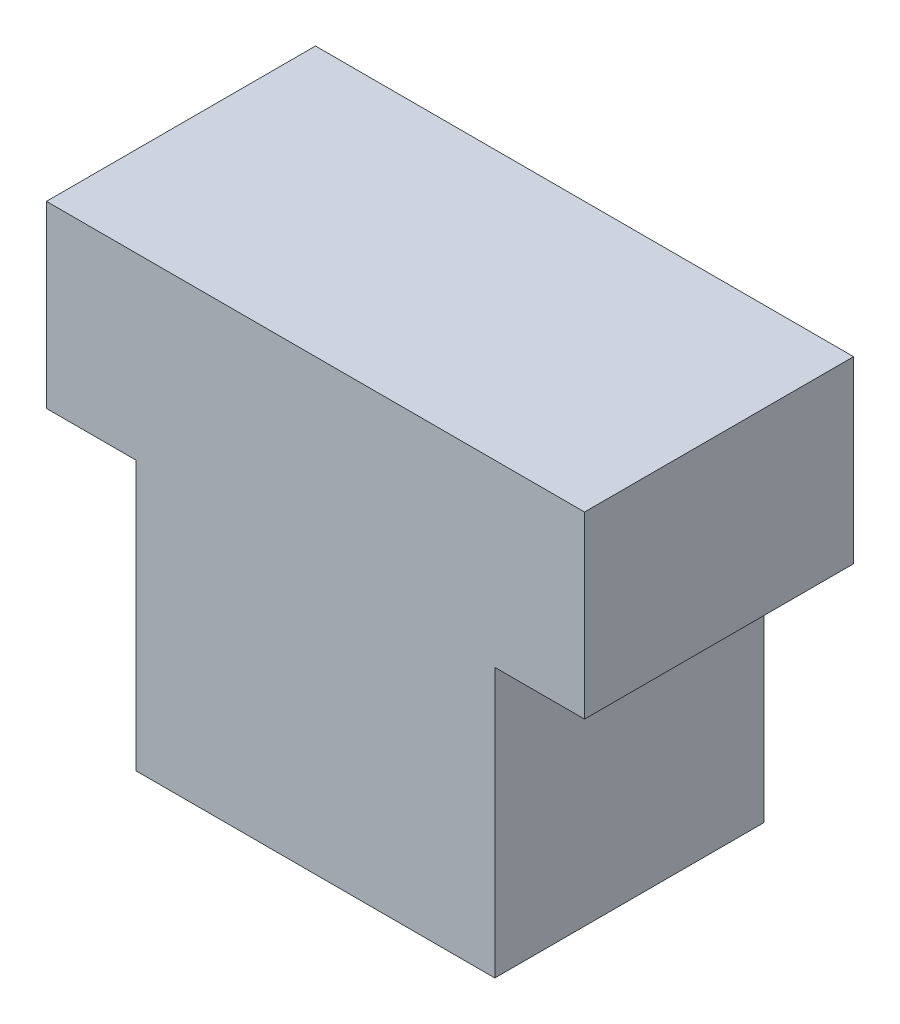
ISO-10303-21;
HEADER;
FILE_DESCRIPTION(('STEP AP214'),'2;1');
FILE_NAME('part.step','',(''),(''),'','','');
FILE_SCHEMA(('AUTOMOTIVE_DESIGN { 1 0 10303 214 1 1 1 1 }'));
ENDSEC;
DATA;
#1=APPLICATION_CONTEXT('core data for automotive mechanical design processes');
#2=APPLICATION_PROTOCOL_DEFINITION('international standard','automotive_design',2000,#1);
#3=PRODUCT_CONTEXT('',#1,'mechanical');
#4=PRODUCT('Part','Part','',(#3));
#5=PRODUCT_RELATED_PRODUCT_CATEGORY('part','',(#4));
#6=PRODUCT_DEFINITION_FORMATION('','',#4);
#7=PRODUCT_DEFINITION_CONTEXT('part definition',#1,'design');
#8=PRODUCT_DEFINITION('design','',#6,#7);
#9=PRODUCT_DEFINITION_SHAPE('','',#8);
#10=(LENGTH_UNIT() NAMED_UNIT(*) SI_UNIT(.MILLI.,.METRE.));
#11=(NAMED_UNIT(*) PLANE_ANGLE_UNIT() SI_UNIT($,.RADIAN.));
#12=(NAMED_UNIT(*) SI_UNIT($,.STERADIAN.) SOLID_ANGLE_UNIT());
#13=UNCERTAINTY_MEASURE_WITH_UNIT(LENGTH_MEASURE(1.E-05),#10,'distance_accuracy_value','');
#14=(GEOMETRIC_REPRESENTATION_CONTEXT(3) GLOBAL_UNCERTAINTY_ASSIGNED_CONTEXT((#13)) GLOBAL_UNIT_ASSIGNED_CONTEXT((#10,
#11,#12)) REPRESENTATION_CONTEXT('',''));
#15=CARTESIAN_POINT('',(0.,0.,0.));
#16=DIRECTION('',(0.,0.,1.));
#17=DIRECTION('',(1.,0.,0.));
#18=AXIS2_PLACEMENT_3D('',#15,#16,#17);
#19=CARTESIAN_POINT('',(20.,0.,15.));
#20=DIRECTION('',(0.,1.,0.));
#21=DIRECTION('',(-1.,0.,0.));
#22=AXIS2_PLACEMENT_3D('',#19,#20,#21);
#23=PLANE('',#22);
#24=DIRECTION('',(1.,0.,0.));
#25=VECTOR('',#24,1.);
#26=CARTESIAN_POINT('',(20.,0.,0.));
#27=LINE('',#26,#25);
#28=CARTESIAN_POINT('',(0.,0.,0.));
#29=VERTEX_POINT('',#28);
#30=CARTESIAN_POINT('',(20.,0.,0.));
#31=VERTEX_POINT('',#30);
#32=EDGE_CURVE('E144',#29,#31,#27,.T.);
#33=ORIENTED_EDGE('',*,*,#32,.T.);
#34=DIRECTION('',(0.,0.,-1.));
#35=VECTOR('',#34,1.);
#36=CARTESIAN_POINT('',(20.,0.,15.));
#37=LINE('',#36,#35);
#38=CARTESIAN_POINT('',(20.,0.,15.));
#39=VERTEX_POINT('',#38);
#40=EDGE_CURVE('E11',#39,#31,#37,.T.);
#41=ORIENTED_EDGE('',*,*,#40,.F.);
#42=DIRECTION('',(1.,0.,0.));
#43=VECTOR('',#42,1.);
#44=CARTESIAN_POINT('',(20.,0.,15.));
#45=LINE('',#44,#43);
#46=CARTESIAN_POINT('',(0.,0.,15.));
#47=VERTEX_POINT('',#46);
#48=EDGE_CURVE('E166',#47,#39,#45,.T.);
#49=ORIENTED_EDGE('',*,*,#48,.F.);
#50=DIRECTION('',(0.,0.,-1.));
#51=VECTOR('',#50,1.);
#52=CARTESIAN_POINT('',(0.,0.,15.));
#53=LINE('',#52,#51);
#54=EDGE_CURVE('E140',#47,#29,#53,.T.);
#55=ORIENTED_EDGE('',*,*,#54,.T.);
#56=EDGE_LOOP('',(#33,#41,#49,#55));
#57=FACE_BOUND('',#56,.T.);
#58=ADVANCED_FACE('F43',(#57),#23,.F.);
#59=CARTESIAN_POINT('',(20.,15.,15.));
#60=DIRECTION('',(-1.,0.,0.));
#61=DIRECTION('',(0.,-1.,0.));
#62=AXIS2_PLACEMENT_3D('',#59,#60,#61);
#63=PLANE('',#62);
#64=DIRECTION('',(0.,1.,0.));
#65=VECTOR('',#64,1.);
#66=CARTESIAN_POINT('',(20.,15.,0.));
#67=LINE('',#66,#65);
#68=CARTESIAN_POINT('',(20.,15.,0.));
#69=VERTEX_POINT('',#68);
#70=EDGE_CURVE('E148',#31,#69,#67,.T.);
#71=ORIENTED_EDGE('',*,*,#70,.T.);
#72=DIRECTION('',(0.,0.,-1.));
#73=VECTOR('',#72,1.);
#74=CARTESIAN_POINT('',(20.,15.,15.));
#75=LINE('',#74,#73);
#76=CARTESIAN_POINT('',(20.,15.,15.));
#77=VERTEX_POINT('',#76);
#78=EDGE_CURVE('E52',#77,#69,#75,.T.);
#79=ORIENTED_EDGE('',*,*,#78,.F.);
#80=DIRECTION('',(0.,1.,0.));
#81=VECTOR('',#80,1.);
#82=CARTESIAN_POINT('',(20.,15.,15.));
#83=LINE('',#82,#81);
#84=EDGE_CURVE('E103',#39,#77,#83,.T.);
#85=ORIENTED_EDGE('',*,*,#84,.F.);
#86=ORIENTED_EDGE('',*,*,#40,.T.);
#87=EDGE_LOOP('',(#71,#79,#85,#86));
#88=FACE_BOUND('',#87,.T.);
#89=ADVANCED_FACE('F212',(#88),#63,.F.);
#90=CARTESIAN_POINT('',(25.,15.,15.));
#91=DIRECTION('',(0.,1.,0.));
#92=DIRECTION('',(-1.,0.,0.));
#93=AXIS2_PLACEMENT_3D('',#90,#91,#92);
#94=PLANE('',#93);
#95=DIRECTION('',(1.,0.,0.));
#96=VECTOR('',#95,1.);
#97=CARTESIAN_POINT('',(25.,15.,0.));
#98=LINE('',#97,#96);
#99=CARTESIAN_POINT('',(25.,15.,0.));
#100=VERTEX_POINT('',#99);
#101=EDGE_CURVE('E151',#69,#100,#98,.T.);
#102=ORIENTED_EDGE('',*,*,#101,.T.);
#103=DIRECTION('',(0.,0.,-1.));
#104=VECTOR('',#103,1.);
#105=CARTESIAN_POINT('',(25.,15.,15.));
#106=LINE('',#105,#104);
#107=CARTESIAN_POINT('',(25.,15.,15.));
#108=VERTEX_POINT('',#107);
#109=EDGE_CURVE('E177',#108,#100,#106,.T.);
#110=ORIENTED_EDGE('',*,*,#109,.F.);
#111=DIRECTION('',(1.,0.,0.));
#112=VECTOR('',#111,1.);
#113=CARTESIAN_POINT('',(25.,15.,15.));
#114=LINE('',#113,#112);
#115=EDGE_CURVE('E187',#77,#108,#114,.T.);
#116=ORIENTED_EDGE('',*,*,#115,.F.);
#117=ORIENTED_EDGE('',*,*,#78,.T.);
#118=EDGE_LOOP('',(#102,#110,#116,#117));
#119=FACE_BOUND('',#118,.T.);
#120=ADVANCED_FACE('F185',(#119),#94,.F.);
#121=CARTESIAN_POINT('',(25.,25.,15.));
#122=DIRECTION('',(-1.,0.,0.));
#123=DIRECTION('',(0.,-1.,0.));
#124=AXIS2_PLACEMENT_3D('',#121,#122,#123);
#125=PLANE('',#124);
#126=DIRECTION('',(0.,1.,0.));
#127=VECTOR('',#126,1.);
#128=CARTESIAN_POINT('',(25.,25.,0.));
#129=LINE('',#128,#127);
#130=CARTESIAN_POINT('',(25.,25.,0.));
#131=VERTEX_POINT('',#130);
#132=EDGE_CURVE('E154',#100,#131,#129,.T.);
#133=ORIENTED_EDGE('',*,*,#132,.T.);
#134=DIRECTION('',(0.,0.,-1.));
#135=VECTOR('',#134,1.);
#136=CARTESIAN_POINT('',(25.,25.,15.));
#137=LINE('',#136,#135);
#138=CARTESIAN_POINT('',(25.,25.,15.));
#139=VERTEX_POINT('',#138);
#140=EDGE_CURVE('E173',#139,#131,#137,.T.);
#141=ORIENTED_EDGE('',*,*,#140,.F.);
#142=DIRECTION('',(0.,1.,0.));
#143=VECTOR('',#142,1.);
#144=CARTESIAN_POINT('',(25.,25.,15.));
#145=LINE('',#144,#143);
#146=EDGE_CURVE('E200',#108,#139,#145,.T.);
#147=ORIENTED_EDGE('',*,*,#146,.F.);
#148=ORIENTED_EDGE('',*,*,#109,.T.);
#149=EDGE_LOOP('',(#133,#141,#147,#148));
#150=FACE_BOUND('',#149,.T.);
#151=ADVANCED_FACE('F195',(#150),#125,.F.);
#152=CARTESIAN_POINT('',(-5.,25.,15.));
#153=DIRECTION('',(0.,-1.,0.));
#154=DIRECTION('',(1.,0.,0.));
#155=AXIS2_PLACEMENT_3D('',#152,#153,#154);
#156=PLANE('',#155);
#157=DIRECTION('',(-1.,0.,0.));
#158=VECTOR('',#157,1.);
#159=CARTESIAN_POINT('',(-5.,25.,0.));
#160=LINE('',#159,#158);
#161=CARTESIAN_POINT('',(-5.,25.,0.));
#162=VERTEX_POINT('',#161);
#163=EDGE_CURVE('E157',#131,#162,#160,.T.);
#164=ORIENTED_EDGE('',*,*,#163,.T.);
#165=DIRECTION('',(0.,0.,-1.));
#166=VECTOR('',#165,1.);
#167=CARTESIAN_POINT('',(-5.,25.,15.));
#168=LINE('',#167,#166);
#169=CARTESIAN_POINT('',(-5.,25.,15.));
#170=VERTEX_POINT('',#169);
#171=EDGE_CURVE('E133',#170,#162,#168,.T.);
#172=ORIENTED_EDGE('',*,*,#171,.F.);
#173=DIRECTION('',(-1.,0.,0.));
#174=VECTOR('',#173,1.);
#175=CARTESIAN_POINT('',(-5.,25.,15.));
#176=LINE('',#175,#174);
#177=EDGE_CURVE('E122',#139,#170,#176,.T.);
#178=ORIENTED_EDGE('',*,*,#177,.F.);
#179=ORIENTED_EDGE('',*,*,#140,.T.);
#180=EDGE_LOOP('',(#164,#172,#178,#179));
#181=FACE_BOUND('',#180,.T.);
#182=ADVANCED_FACE('F198',(#181),#156,.F.);
#183=CARTESIAN_POINT('',(-5.,15.,15.));
#184=DIRECTION('',(1.,0.,0.));
#185=DIRECTION('',(0.,1.,0.));
#186=AXIS2_PLACEMENT_3D('',#183,#184,#185);
#187=PLANE('',#186);
#188=DIRECTION('',(0.,-1.,0.));
#189=VECTOR('',#188,1.);
#190=CARTESIAN_POINT('',(-5.,15.,0.));
#191=LINE('',#190,#189);
#192=CARTESIAN_POINT('',(-5.,15.,0.));
#193=VERTEX_POINT('',#192);
#194=EDGE_CURVE('E131',#162,#193,#191,.T.);
#195=ORIENTED_EDGE('',*,*,#194,.T.);
#196=DIRECTION('',(0.,0.,-1.));
#197=VECTOR('',#196,1.);
#198=CARTESIAN_POINT('',(-5.,15.,15.));
#199=LINE('',#198,#197);
#200=CARTESIAN_POINT('',(-5.,15.,15.));
#201=VERTEX_POINT('',#200);
#202=EDGE_CURVE('E128',#201,#193,#199,.T.);
#203=ORIENTED_EDGE('',*,*,#202,.F.);
#204=DIRECTION('',(0.,-1.,0.));
#205=VECTOR('',#204,1.);
#206=CARTESIAN_POINT('',(-5.,15.,15.));
#207=LINE('',#206,#205);
#208=EDGE_CURVE('E116',#170,#201,#207,.T.);
#209=ORIENTED_EDGE('',*,*,#208,.F.);
#210=ORIENTED_EDGE('',*,*,#171,.T.);
#211=EDGE_LOOP('',(#195,#203,#209,#210));
#212=FACE_BOUND('',#211,.T.);
#213=ADVANCED_FACE('F129',(#212),#187,.F.);
#214=CARTESIAN_POINT('',(0.,15.,15.));
#215=DIRECTION('',(0.,1.,0.));
#216=DIRECTION('',(0.,0.,1.));
#217=AXIS2_PLACEMENT_3D('',#214,#215,#216);
#218=PLANE('',#217);
#219=DIRECTION('',(1.,0.,0.));
#220=VECTOR('',#219,1.);
#221=CARTESIAN_POINT('',(0.,15.,0.));
#222=LINE('',#221,#220);
#223=CARTESIAN_POINT('',(0.,15.,0.));
#224=VERTEX_POINT('',#223);
#225=EDGE_CURVE('E89',#193,#224,#222,.T.);
#226=ORIENTED_EDGE('',*,*,#225,.T.);
#227=DIRECTION('',(0.,0.,-1.));
#228=VECTOR('',#227,1.);
#229=CARTESIAN_POINT('',(0.,15.,15.));
#230=LINE('',#229,#228);
#231=CARTESIAN_POINT('',(0.,15.,15.));
#232=VERTEX_POINT('',#231);
#233=EDGE_CURVE('E134',#232,#224,#230,.T.);
#234=ORIENTED_EDGE('',*,*,#233,.F.);
#235=DIRECTION('',(1.,0.,0.));
#236=VECTOR('',#235,1.);
#237=CARTESIAN_POINT('',(0.,15.,15.));
#238=LINE('',#237,#236);
#239=EDGE_CURVE('E120',#201,#232,#238,.T.);
#240=ORIENTED_EDGE('',*,*,#239,.F.);
#241=ORIENTED_EDGE('',*,*,#202,.T.);
#242=EDGE_LOOP('',(#226,#234,#240,#241));
#243=FACE_BOUND('',#242,.T.);
#244=ADVANCED_FACE('F136',(#243),#218,.F.);
#245=CARTESIAN_POINT('',(0.,0.,15.));
#246=DIRECTION('',(1.,0.,0.));
#247=DIRECTION('',(0.,0.,-1.));
#248=AXIS2_PLACEMENT_3D('',#245,#246,#247);
#249=PLANE('',#248);
#250=DIRECTION('',(0.,-1.,0.));
#251=VECTOR('',#250,1.);
#252=CARTESIAN_POINT('',(0.,0.,0.));
#253=LINE('',#252,#251);
#254=EDGE_CURVE('E95',#224,#29,#253,.T.);
#255=ORIENTED_EDGE('',*,*,#254,.T.);
#256=ORIENTED_EDGE('',*,*,#54,.F.);
#257=DIRECTION('',(0.,-1.,0.));
#258=VECTOR('',#257,1.);
#259=CARTESIAN_POINT('',(0.,0.,15.));
#260=LINE('',#259,#258);
#261=EDGE_CURVE('E60',#232,#47,#260,.T.);
#262=ORIENTED_EDGE('',*,*,#261,.F.);
#263=ORIENTED_EDGE('',*,*,#233,.T.);
#264=EDGE_LOOP('',(#255,#256,#262,#263));
#265=FACE_BOUND('',#264,.T.);
#266=ADVANCED_FACE('F228',(#265),#249,.F.);
#267=CARTESIAN_POINT('',(0.,0.,15.));
#268=DIRECTION('',(0.,0.,-1.));
#269=DIRECTION('',(-1.,0.,0.));
#270=AXIS2_PLACEMENT_3D('',#267,#268,#269);
#271=PLANE('',#270);
#272=ORIENTED_EDGE('',*,*,#48,.T.);
#273=ORIENTED_EDGE('',*,*,#84,.T.);
#274=ORIENTED_EDGE('',*,*,#115,.T.);
#275=ORIENTED_EDGE('',*,*,#146,.T.);
#276=ORIENTED_EDGE('',*,*,#177,.T.);
#277=ORIENTED_EDGE('',*,*,#208,.T.);
#278=ORIENTED_EDGE('',*,*,#239,.T.);
#279=ORIENTED_EDGE('',*,*,#261,.T.);
#280=EDGE_LOOP('',(#272,#273,#274,#275,#276,#277,#278,#279));
#281=FACE_BOUND('',#280,.T.);
#282=ADVANCED_FACE('F118',(#281),#271,.F.);
#283=CARTESIAN_POINT('',(0.,0.,0.));
#284=DIRECTION('',(0.,0.,-1.));
#285=DIRECTION('',(-1.,0.,0.));
#286=AXIS2_PLACEMENT_3D('',#283,#284,#285);
#287=PLANE('',#286);
#288=ORIENTED_EDGE('',*,*,#32,.F.);
#289=ORIENTED_EDGE('',*,*,#254,.F.);
#290=ORIENTED_EDGE('',*,*,#225,.F.);
#291=ORIENTED_EDGE('',*,*,#194,.F.);
#292=ORIENTED_EDGE('',*,*,#163,.F.);
#293=ORIENTED_EDGE('',*,*,#132,.F.);
#294=ORIENTED_EDGE('',*,*,#101,.F.);
#295=ORIENTED_EDGE('',*,*,#70,.F.);
#296=EDGE_LOOP('',(#288,#289,#290,#291,#292,#293,#294,#295));
#297=FACE_BOUND('',#296,.T.);
#298=ADVANCED_FACE('F191',(#297),#287,.T.);
#299=CLOSED_SHELL('',(#58,#89,#120,#151,#182,#213,#244,#266,#282,#298));
#300=MANIFOLD_SOLID_BREP('B2',#299);
#301=ADVANCED_BREP_SHAPE_REPRESENTATION('',(#18,#300),#14);
#302=SHAPE_DEFINITION_REPRESENTATION(#9,#301);
ENDSEC;
END-ISO-10303-21;
